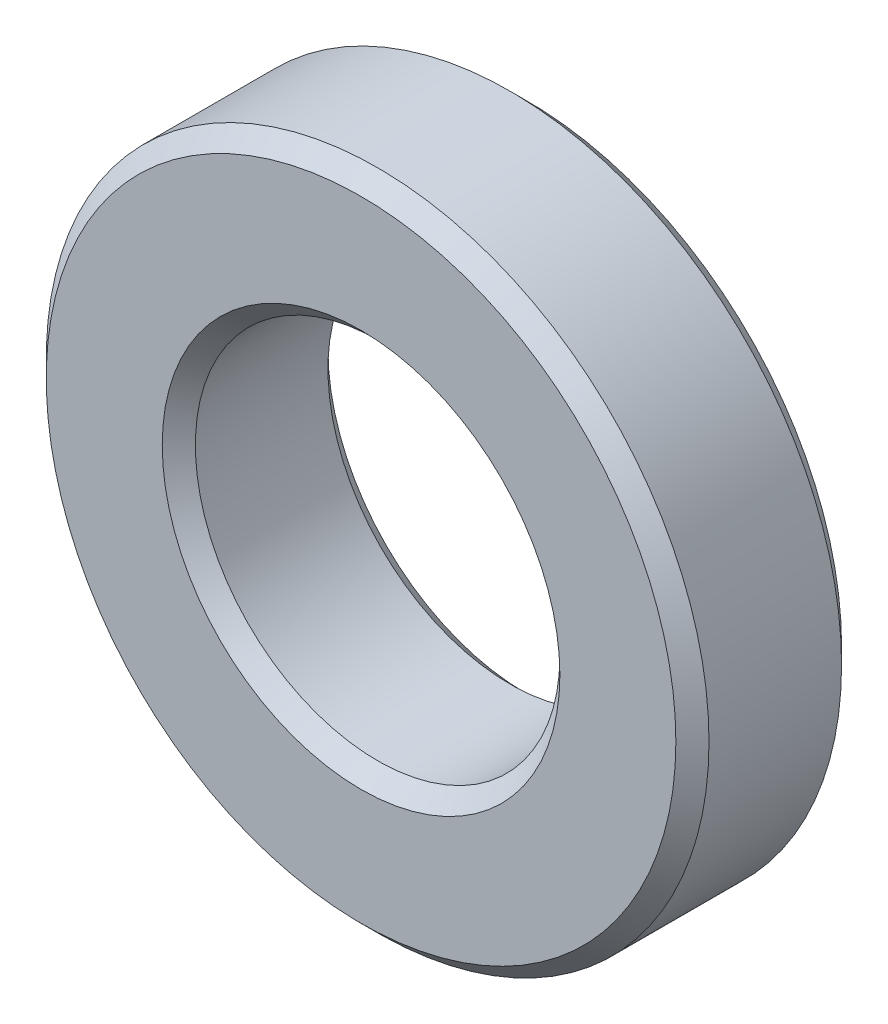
ISO-10303-21;
HEADER;
FILE_DESCRIPTION(('STEP AP214'),'2;1');
FILE_NAME('part.step','',(''),(''),'','','');
FILE_SCHEMA(('AUTOMOTIVE_DESIGN { 1 0 10303 214 1 1 1 1 }'));
ENDSEC;
DATA;
#1=APPLICATION_CONTEXT('core data for automotive mechanical design processes');
#2=APPLICATION_PROTOCOL_DEFINITION('international standard','automotive_design',2000,#1);
#3=PRODUCT_CONTEXT('',#1,'mechanical');
#4=PRODUCT('Part','Part','',(#3));
#5=PRODUCT_RELATED_PRODUCT_CATEGORY('part','',(#4));
#6=PRODUCT_DEFINITION_FORMATION('','',#4);
#7=PRODUCT_DEFINITION_CONTEXT('part definition',#1,'design');
#8=PRODUCT_DEFINITION('design','',#6,#7);
#9=PRODUCT_DEFINITION_SHAPE('','',#8);
#10=(LENGTH_UNIT() NAMED_UNIT(*) SI_UNIT(.MILLI.,.METRE.));
#11=(NAMED_UNIT(*) PLANE_ANGLE_UNIT() SI_UNIT($,.RADIAN.));
#12=(NAMED_UNIT(*) SI_UNIT($,.STERADIAN.) SOLID_ANGLE_UNIT());
#13=UNCERTAINTY_MEASURE_WITH_UNIT(LENGTH_MEASURE(1.E-05),#10,'distance_accuracy_value','');
#14=(GEOMETRIC_REPRESENTATION_CONTEXT(3) GLOBAL_UNCERTAINTY_ASSIGNED_CONTEXT((#13)) GLOBAL_UNIT_ASSIGNED_CONTEXT((#10,
#11,#12)) REPRESENTATION_CONTEXT('',''));
#15=CARTESIAN_POINT('',(0.,0.,0.));
#16=DIRECTION('',(0.,0.,1.));
#17=DIRECTION('',(1.,0.,0.));
#18=AXIS2_PLACEMENT_3D('',#15,#16,#17);
#19=CARTESIAN_POINT('',(0.,0.,0.5));
#20=DIRECTION('',(0.,0.,1.));
#21=DIRECTION('',(1.,0.,0.));
#22=AXIS2_PLACEMENT_3D('',#19,#20,#21);
#23=PLANE('',#22);
#24=CARTESIAN_POINT('',(0.,0.,0.5));
#25=DIRECTION('',(0.,0.,1.));
#26=DIRECTION('',(1.,0.,0.));
#27=AXIS2_PLACEMENT_3D('',#24,#25,#26);
#28=CIRCLE('',#27,1.2);
#29=CARTESIAN_POINT('',(1.2,0.,0.5));
#30=VERTEX_POINT('',#29);
#31=EDGE_CURVE('E10',#30,#30,#28,.F.);
#32=ORIENTED_EDGE('',*,*,#31,.T.);
#33=EDGE_LOOP('',(#32));
#34=FACE_BOUND('',#33,.T.);
#35=CARTESIAN_POINT('',(0.,0.,0.5));
#36=DIRECTION('',(0.,0.,1.));
#37=DIRECTION('',(1.,0.,0.));
#38=AXIS2_PLACEMENT_3D('',#35,#36,#37);
#39=CIRCLE('',#38,1.9);
#40=CARTESIAN_POINT('',(1.9,0.,0.5));
#41=VERTEX_POINT('',#40);
#42=EDGE_CURVE('E45',#41,#41,#39,.T.);
#43=ORIENTED_EDGE('',*,*,#42,.T.);
#44=EDGE_LOOP('',(#43));
#45=FACE_BOUND('',#44,.T.);
#46=ADVANCED_FACE('F37',(#34,#45),#23,.T.);
#47=CARTESIAN_POINT('',(0.,0.,-0.5));
#48=DIRECTION('',(0.,0.,1.));
#49=DIRECTION('',(1.,0.,0.));
#50=AXIS2_PLACEMENT_3D('',#47,#48,#49);
#51=PLANE('',#50);
#52=CARTESIAN_POINT('',(0.,0.,-0.5));
#53=DIRECTION('',(0.,0.,1.));
#54=DIRECTION('',(1.,0.,0.));
#55=AXIS2_PLACEMENT_3D('',#52,#53,#54);
#56=CIRCLE('',#55,1.9);
#57=CARTESIAN_POINT('',(1.9,0.,-0.5));
#58=VERTEX_POINT('',#57);
#59=EDGE_CURVE('E64',#58,#58,#56,.F.);
#60=ORIENTED_EDGE('',*,*,#59,.T.);
#61=EDGE_LOOP('',(#60));
#62=FACE_BOUND('',#61,.T.);
#63=CARTESIAN_POINT('',(0.,0.,-0.5));
#64=DIRECTION('',(0.,0.,1.));
#65=DIRECTION('',(1.,0.,0.));
#66=AXIS2_PLACEMENT_3D('',#63,#64,#65);
#67=CIRCLE('',#66,1.2);
#68=CARTESIAN_POINT('',(1.2,0.,-0.5));
#69=VERTEX_POINT('',#68);
#70=EDGE_CURVE('E67',#69,#69,#67,.T.);
#71=ORIENTED_EDGE('',*,*,#70,.T.);
#72=EDGE_LOOP('',(#71));
#73=FACE_BOUND('',#72,.T.);
#74=ADVANCED_FACE('F89',(#62,#73),#51,.F.);
#75=CARTESIAN_POINT('',(0.,0.,0.5));
#76=DIRECTION('',(0.,0.,-1.));
#77=DIRECTION('',(-1.,0.,0.));
#78=AXIS2_PLACEMENT_3D('',#75,#76,#77);
#79=CYLINDRICAL_SURFACE('',#78,2.);
#80=CARTESIAN_POINT('',(0.,0.,-0.4));
#81=DIRECTION('',(0.,0.,1.));
#82=DIRECTION('',(1.,0.,0.));
#83=AXIS2_PLACEMENT_3D('',#80,#81,#82);
#84=CIRCLE('',#83,2.);
#85=CARTESIAN_POINT('',(2.,0.,-0.4));
#86=VERTEX_POINT('',#85);
#87=EDGE_CURVE('E70',#86,#86,#84,.T.);
#88=ORIENTED_EDGE('',*,*,#87,.T.);
#89=EDGE_LOOP('',(#88));
#90=FACE_BOUND('',#89,.T.);
#91=CARTESIAN_POINT('',(0.,0.,0.4));
#92=DIRECTION('',(0.,0.,1.));
#93=DIRECTION('',(1.,0.,0.));
#94=AXIS2_PLACEMENT_3D('',#91,#92,#93);
#95=CIRCLE('',#94,2.);
#96=CARTESIAN_POINT('',(2.,0.,0.4));
#97=VERTEX_POINT('',#96);
#98=EDGE_CURVE('E73',#97,#97,#95,.F.);
#99=ORIENTED_EDGE('',*,*,#98,.T.);
#100=EDGE_LOOP('',(#99));
#101=FACE_BOUND('',#100,.T.);
#102=ADVANCED_FACE('F78',(#90,#101),#79,.T.);
#103=CARTESIAN_POINT('',(0.,0.,0.5));
#104=DIRECTION('',(0.,0.,-1.));
#105=DIRECTION('',(-1.,0.,0.));
#106=AXIS2_PLACEMENT_3D('',#103,#104,#105);
#107=CYLINDRICAL_SURFACE('',#106,1.1);
#108=CARTESIAN_POINT('',(0.,0.,-0.400000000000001));
#109=DIRECTION('',(0.,0.,1.));
#110=DIRECTION('',(1.,0.,0.));
#111=AXIS2_PLACEMENT_3D('',#108,#109,#110);
#112=CIRCLE('',#111,1.1);
#113=CARTESIAN_POINT('',(1.1,0.,-0.400000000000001));
#114=VERTEX_POINT('',#113);
#115=EDGE_CURVE('E51',#114,#114,#112,.F.);
#116=ORIENTED_EDGE('',*,*,#115,.T.);
#117=EDGE_LOOP('',(#116));
#118=FACE_BOUND('',#117,.T.);
#119=CARTESIAN_POINT('',(0.,0.,0.4));
#120=DIRECTION('',(0.,0.,1.));
#121=DIRECTION('',(1.,0.,0.));
#122=AXIS2_PLACEMENT_3D('',#119,#120,#121);
#123=CIRCLE('',#122,1.1);
#124=CARTESIAN_POINT('',(1.1,0.,0.4));
#125=VERTEX_POINT('',#124);
#126=EDGE_CURVE('E58',#125,#125,#123,.T.);
#127=ORIENTED_EDGE('',*,*,#126,.T.);
#128=EDGE_LOOP('',(#127));
#129=FACE_BOUND('',#128,.T.);
#130=ADVANCED_FACE('F97',(#118,#129),#107,.F.);
#131=CARTESIAN_POINT('',(0.,0.,-0.4));
#132=DIRECTION('',(0.,0.,1.));
#133=DIRECTION('',(1.,0.,0.));
#134=AXIS2_PLACEMENT_3D('',#131,#132,#133);
#135=CONICAL_SURFACE('',#134,2.,0.785398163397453);
#136=ORIENTED_EDGE('',*,*,#59,.F.);
#137=EDGE_LOOP('',(#136));
#138=FACE_BOUND('',#137,.T.);
#139=ORIENTED_EDGE('',*,*,#87,.F.);
#140=EDGE_LOOP('',(#139));
#141=FACE_BOUND('',#140,.T.);
#142=ADVANCED_FACE('F102',(#138,#141),#135,.T.);
#143=CARTESIAN_POINT('',(0.,0.,-0.5));
#144=DIRECTION('',(0.,0.,-1.));
#145=DIRECTION('',(-1.,0.,0.));
#146=AXIS2_PLACEMENT_3D('',#143,#144,#145);
#147=CONICAL_SURFACE('',#146,1.2,0.785398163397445);
#148=ORIENTED_EDGE('',*,*,#115,.F.);
#149=EDGE_LOOP('',(#148));
#150=FACE_BOUND('',#149,.T.);
#151=ORIENTED_EDGE('',*,*,#70,.F.);
#152=EDGE_LOOP('',(#151));
#153=FACE_BOUND('',#152,.T.);
#154=ADVANCED_FACE('F86',(#150,#153),#147,.F.);
#155=CARTESIAN_POINT('',(0.,0.,0.4));
#156=DIRECTION('',(0.,0.,1.));
#157=DIRECTION('',(1.,0.,0.));
#158=AXIS2_PLACEMENT_3D('',#155,#156,#157);
#159=CONICAL_SURFACE('',#158,1.1,0.785398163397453);
#160=ORIENTED_EDGE('',*,*,#31,.F.);
#161=EDGE_LOOP('',(#160));
#162=FACE_BOUND('',#161,.T.);
#163=ORIENTED_EDGE('',*,*,#126,.F.);
#164=EDGE_LOOP('',(#163));
#165=FACE_BOUND('',#164,.T.);
#166=ADVANCED_FACE('F82',(#162,#165),#159,.F.);
#167=CARTESIAN_POINT('',(0.,0.,0.5));
#168=DIRECTION('',(0.,0.,-1.));
#169=DIRECTION('',(-1.,0.,0.));
#170=AXIS2_PLACEMENT_3D('',#167,#168,#169);
#171=CONICAL_SURFACE('',#170,1.9,0.785398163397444);
#172=ORIENTED_EDGE('',*,*,#98,.F.);
#173=EDGE_LOOP('',(#172));
#174=FACE_BOUND('',#173,.T.);
#175=ORIENTED_EDGE('',*,*,#42,.F.);
#176=EDGE_LOOP('',(#175));
#177=FACE_BOUND('',#176,.T.);
#178=ADVANCED_FACE('F39',(#174,#177),#171,.T.);
#179=CLOSED_SHELL('',(#46,#74,#102,#130,#142,#154,#166,#178));
#180=MANIFOLD_SOLID_BREP('B2',#179);
#181=ADVANCED_BREP_SHAPE_REPRESENTATION('',(#18,#180),#14);
#182=SHAPE_DEFINITION_REPRESENTATION(#9,#181);
ENDSEC;
END-ISO-10303-21;
